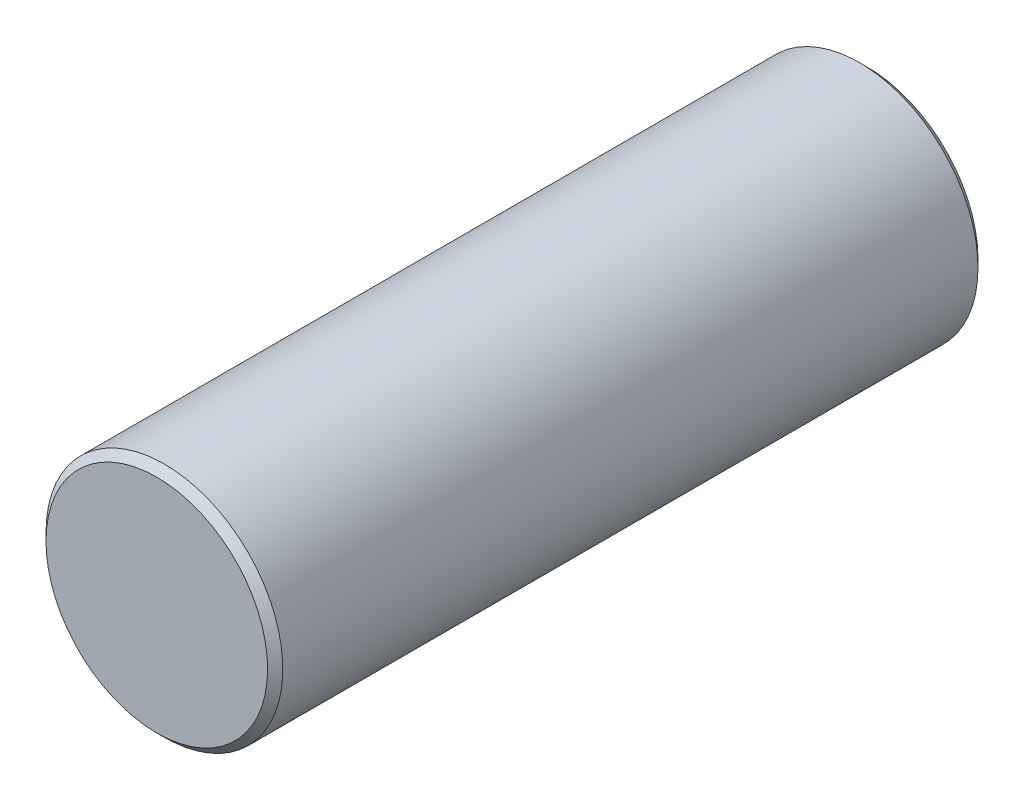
from build123d import *

# Parameters (mm, degrees)
SKETCH1_R      = 6.35
EXTRUDE1_DEPTH = 19.05
CHAMFER1_SIZE  = 0.4064


with BuildPart() as part:
    # Sketch1 → Extrude1 (new, symmetric)
    with BuildSketch(Plane.XY):
        with Locations(Location((0, 0, 0), (0, 0, 180))):
            Circle(SKETCH1_R)
    extrude(amount=EXTRUDE1_DEPTH, both=True)

    # Chamfer1
    chamfer1_edges = [part.edges().sort_by_distance(p)[0] for p in [
        (6.35, 0, -19.05),
        (6.35, 0, 19.05),
    ]]
    chamfer(chamfer1_edges, length=CHAMFER1_SIZE)


solid = part.part
